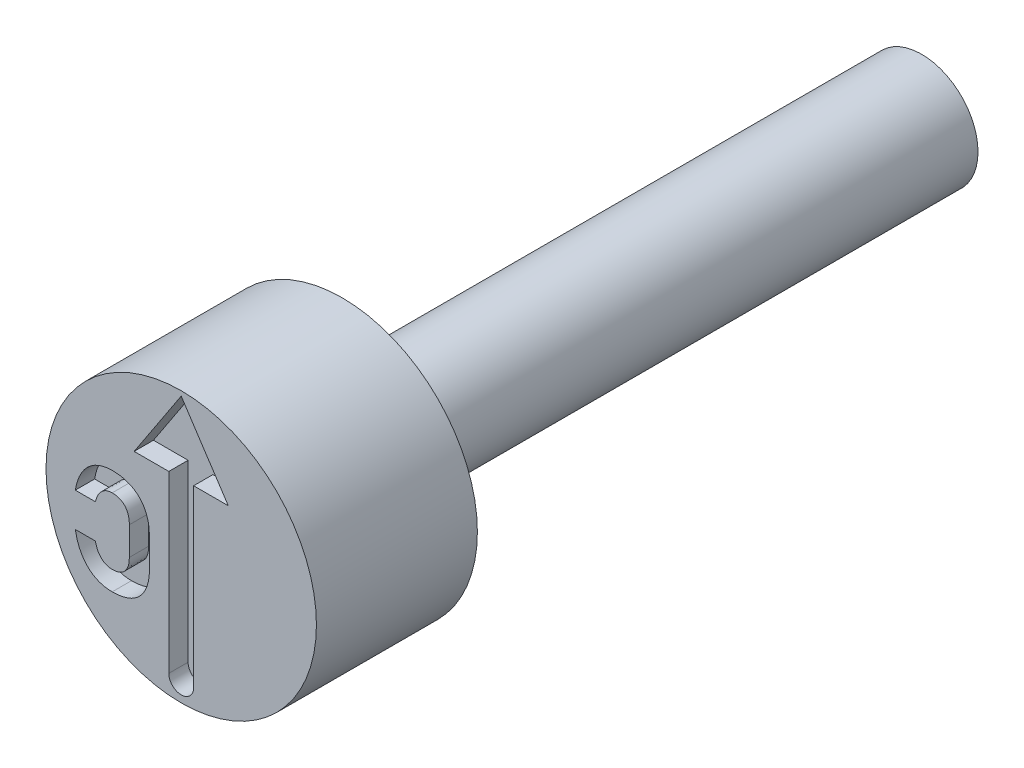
from build123d import *

# Parameters (mm, degrees)
CUT_EXTRUDE4_DEPTH = 0.6
CUT_EXTRUDE5_DEPTH = 0.6


with BuildPart() as part:
    # Sketch2 → Revolve1 (revolve)
    with BuildSketch(Plane(origin=(0, 0, 0), x_dir=(0, 0, -1), z_dir=(1, 0, 0)), mode=Mode.PRIVATE) as revolve1_sk:
        Polygon((0, 4.2), (0, 0), (23, 0), (23, 1.75), (5, 1.75), (5, 4.2), align=None)
    revolve(revolve1_sk.sketch.rotate(Axis((0, 0, -0.403888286), (0, 0, -1)), 90), axis=Axis((0, 0, -0.403888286), (0, 0, -1)))

    # Sketch3 → Cut-Extrude4 (cut)
    with BuildSketch(Plane.XY):
        with BuildLine():
            Line((0.385708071, 1.835361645), (0.385708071, -3.596727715))
            ThreePointArc((0.385708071, -3.596727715), (0, -3.982435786), (-0.385708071, -3.596727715))
            Line((-0.385708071, -3.596727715), (-0.385708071, 1.835361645))
            Line((-0.385708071, 1.835361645), (-1.461883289, 1.835361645))
            Line((-1.461883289, 1.835361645), (0, 4.054283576))
            Line((0, 4.054283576), (1.461883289, 1.835361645))
            Line((1.461883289, 1.835361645), (0.385708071, 1.835361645))
        make_face()
    extrude(amount=-CUT_EXTRUDE4_DEPTH, mode=Mode.SUBTRACT)

    # Sketch4 → Cut-Extrude5 (cut)
    with BuildSketch(Plane.XY):
        with BuildLine():
            add(Edge.make_bspline(
                [(-2.143814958, -2.28325861), (-2.11402266, -2.282936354), (-2.055233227, -2.282300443), (-1.968788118, -2.275683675), (-1.885389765, -2.264622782), (-1.805492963, -2.249024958), (-1.728877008, -2.229347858), (-1.655213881, -2.206090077), (-1.585212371, -2.177297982), (-1.518193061, -2.14464721), (-1.455099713, -2.107691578), (-1.396066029, -2.066124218), (-1.340506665, -2.021249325), (-1.288843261, -1.972167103), (-1.241129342, -1.919164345), (-1.197093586, -1.862182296), (-1.157640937, -1.800857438), (-1.121549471, -1.73601612), (-1.089439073, -1.667481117), (-1.062337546, -1.594925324), (-1.038840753, -1.519149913), (-1.019185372, -1.440166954), (-1.004136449, -1.357617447), (-0.994105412, -1.271564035), (-0.987151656, -1.181925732), (-0.986577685, -1.120960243), (-0.986284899, -1.089861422)],
                knots=[0, 0, 0, 0, 1.134237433, 2.238201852, 3.298772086, 4.336057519, 5.335809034, 6.309558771, 7.274828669, 8.21507465, 9.146315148, 10.055631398, 10.961815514, 11.863452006, 12.765999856, 13.674901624, 14.60241943, 15.539819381, 16.498894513, 17.481225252, 18.486546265, 19.518401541, 20.578551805, 21.679128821, 22.816111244, 24, 24, 24, 24], degree=3))
            Line((-0.986284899, -1.089861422), (-0.986284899, -0.212094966))
            add(Edge.make_bspline(
                [(-0.986284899, -0.212094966), (-0.986577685, -0.180996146), (-0.987151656, -0.120030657), (-0.994105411, -0.030392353), (-1.004136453, 0.055661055), (-1.019185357, 0.138210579), (-1.038840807, 0.217193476), (-1.062337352, 0.292969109), (-1.089439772, 0.365524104), (-1.121546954, 0.434061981), (-1.157650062, 0.498892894), (-1.197060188, 0.560255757), (-1.241350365, 0.617227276), (-1.288611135, 0.670853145), (-1.340535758, 0.719921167), (-1.396064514, 0.764813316), (-1.455076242, 0.806438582), (-1.51837505, 0.843186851), (-1.585008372, 0.876859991), (-1.655372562, 0.905195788), (-1.72873257, 0.929566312), (-1.805515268, 0.948958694), (-1.885383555, 0.964641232), (-1.968789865, 0.975678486), (-2.055232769, 0.982301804), (-2.114022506, 0.982936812), (-2.143814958, 0.98325861)],
                knots=[0, 0, 0, 0, 1.183277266, 2.319672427, 3.419680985, 4.479283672, 5.510605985, 6.515407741, 7.497231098, 8.455810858, 9.392726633, 10.319765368, 11.22819768, 12.136441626, 13.037612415, 13.943328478, 14.852175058, 15.782934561, 16.726365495, 17.691136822, 18.666946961, 19.666182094, 20.70293176, 21.7629542, 22.866348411, 24, 24, 24, 24], degree=3))
            add(Edge.make_bspline(
                [(-2.143814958, 0.98325861), (-2.192841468, 0.981946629), (-2.288945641, 0.979374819), (-2.428625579, 0.953552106), (-2.560529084, 0.913349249), (-2.683885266, 0.856023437), (-2.79830794, 0.783695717), (-2.902457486, 0.695695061), (-2.996298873, 0.593173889), (-3.079022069, 0.475713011), (-3.150862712, 0.344951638), (-3.210004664, 0.200873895), (-3.258010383, 0.044553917), (-3.279317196, -0.065125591), (-3.290258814, -0.12144895)],
                knots=[0, 0, 0, 0, 1.00806925, 1.976066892, 2.912865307, 3.839664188, 4.766819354, 5.690806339, 6.637604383, 7.619531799, 8.640729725, 9.701744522, 10.819784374, 12, 12, 12, 12], degree=3))
            Line((-3.290258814, -0.12144895), (-2.665518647, -0.12144895))
            add(Edge.make_bspline(
                [(-2.665518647, -0.12144895), (-2.659216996, -0.095887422), (-2.646954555, -0.046147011), (-2.621707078, 0.024612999), (-2.592998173, 0.090155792), (-2.557887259, 0.148919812), (-2.519665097, 0.202323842), (-2.476559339, 0.248591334), (-2.429513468, 0.288489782), (-2.378890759, 0.321488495), (-2.324829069, 0.348381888), (-2.267082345, 0.366180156), (-2.206447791, 0.37780246), (-2.164955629, 0.379283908), (-2.143814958, 0.38003872)],
                knots=[0, 0, 0, 0, 1.203096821, 2.341117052, 3.431111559, 4.469295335, 5.465369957, 6.42892467, 7.35290722, 8.279239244, 9.186115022, 10.104036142, 11.033987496, 12, 12, 12, 12], degree=3))
            add(Edge.make_bspline(
                [(-2.143814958, 0.38003872), (-2.116604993, 0.379086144), (-2.064062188, 0.377246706), (-1.987944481, 0.365263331), (-1.918609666, 0.342688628), (-1.855089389, 0.312740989), (-1.798345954, 0.273953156), (-1.74898758, 0.226402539), (-1.706989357, 0.17073442), (-1.671599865, 0.107906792), (-1.644236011, 0.037386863), (-1.624982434, -0.039955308), (-1.613067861, -0.123906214), (-1.611720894, -0.182055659), (-1.611025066, -0.212094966)],
                knots=[0, 0, 0, 0, 1.082677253, 2.090664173, 3.053339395, 3.973921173, 4.875832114, 5.774919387, 6.688160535, 7.640683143, 8.634736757, 9.687648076, 10.805466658, 12, 12, 12, 12], degree=3))
            Line((-1.611025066, -0.212094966), (-1.611025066, -1.089861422))
            add(Edge.make_bspline(
                [(-1.611025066, -1.089861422), (-1.611728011, -1.1198988), (-1.613088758, -1.178044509), (-1.624877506, -1.261812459), (-1.644381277, -1.338865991), (-1.671440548, -1.409073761), (-1.706984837, -1.471433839), (-1.74919628, -1.52644995), (-1.798318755, -1.573989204), (-1.855114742, -1.612668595), (-1.918473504, -1.642924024), (-1.988152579, -1.664191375), (-2.063966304, -1.677541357), (-2.116584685, -1.679187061), (-2.143814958, -1.68003872)],
                knots=[0, 0, 0, 0, 1.196920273, 2.316972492, 3.363591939, 4.359631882, 5.306515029, 6.214703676, 7.115587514, 8.019300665, 8.94172196, 9.903709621, 10.915159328, 12, 12, 12, 12], degree=3))
            add(Edge.make_bspline(
                [(-2.143814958, -1.68003872), (-2.165369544, -1.679189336), (-2.207646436, -1.677523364), (-2.269408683, -1.667324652), (-2.327559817, -1.648528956), (-2.382492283, -1.623204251), (-2.433803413, -1.590485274), (-2.480030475, -1.550058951), (-2.523088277, -1.504041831), (-2.561411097, -1.450935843), (-2.595382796, -1.391507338), (-2.623792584, -1.325733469), (-2.648453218, -1.254346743), (-2.659713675, -1.20390339), (-2.665518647, -1.17789892)],
                knots=[0, 0, 0, 0, 0.981077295, 1.924272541, 2.837745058, 3.753838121, 4.670304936, 5.59622504, 6.54113043, 7.532377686, 8.569122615, 9.649813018, 10.788435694, 12, 12, 12, 12], degree=3))
            Line((-2.665518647, -1.17789892), (-3.290258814, -1.17789892))
            add(Edge.make_bspline(
                [(-3.290258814, -1.17789892), (-3.279113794, -1.234445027), (-3.25744585, -1.344380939), (-3.208754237, -1.500937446), (-3.148750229, -1.644778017), (-3.07734211, -1.775686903), (-2.994094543, -1.892369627), (-2.900999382, -1.995262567), (-2.797269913, -2.083497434), (-2.683119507, -2.156187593), (-2.5598638, -2.213333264), (-2.428177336, -2.253465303), (-2.288738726, -2.279428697), (-2.192843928, -2.281962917), (-2.143814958, -2.28325861)],
                knots=[0, 0, 0, 0, 1.185884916, 2.305575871, 3.368634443, 4.390138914, 5.368714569, 6.312778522, 7.23993122, 8.163588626, 9.090665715, 10.027745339, 10.991628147, 12, 12, 12, 12], degree=3))
        make_face()
    extrude(amount=-CUT_EXTRUDE5_DEPTH, mode=Mode.SUBTRACT)


solid = part.part
